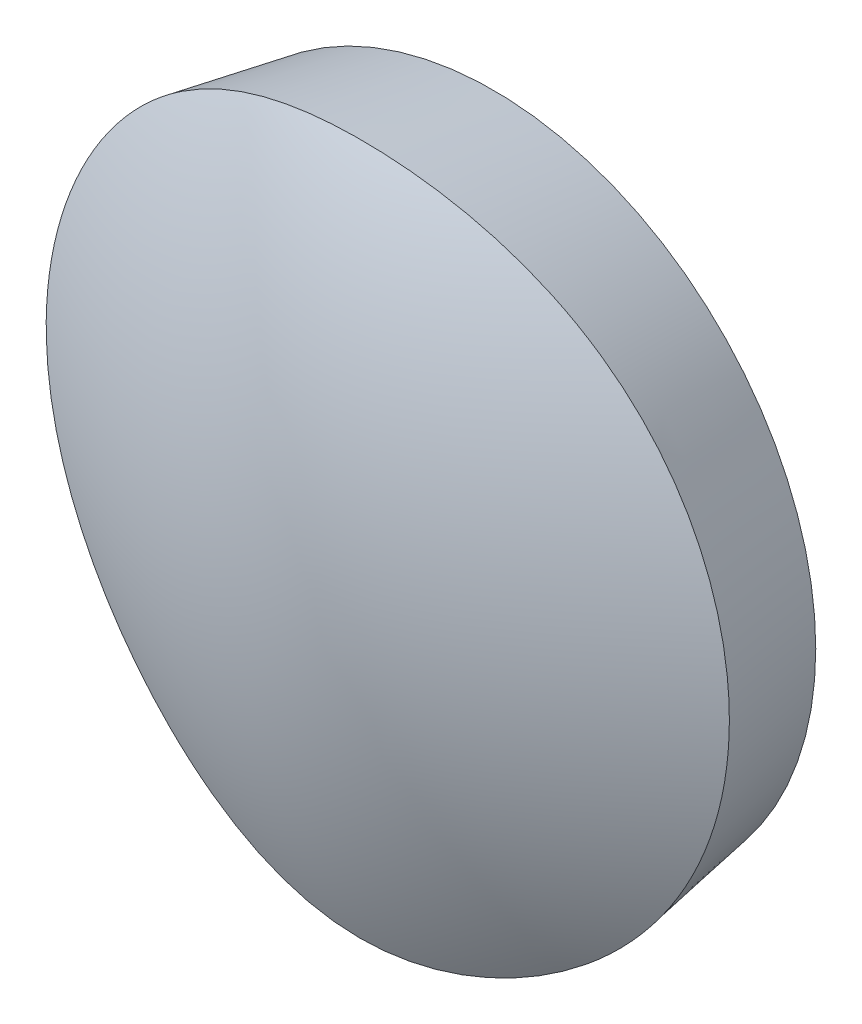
ISO-10303-21;
HEADER;
FILE_DESCRIPTION(('STEP AP214'),'2;1');
FILE_NAME('part.step','',(''),(''),'','','');
FILE_SCHEMA(('AUTOMOTIVE_DESIGN { 1 0 10303 214 1 1 1 1 }'));
ENDSEC;
DATA;
#1=APPLICATION_CONTEXT('core data for automotive mechanical design processes');
#2=APPLICATION_PROTOCOL_DEFINITION('international standard','automotive_design',2000,#1);
#3=PRODUCT_CONTEXT('',#1,'mechanical');
#4=PRODUCT('Part','Part','',(#3));
#5=PRODUCT_RELATED_PRODUCT_CATEGORY('part','',(#4));
#6=PRODUCT_DEFINITION_FORMATION('','',#4);
#7=PRODUCT_DEFINITION_CONTEXT('part definition',#1,'design');
#8=PRODUCT_DEFINITION('design','',#6,#7);
#9=PRODUCT_DEFINITION_SHAPE('','',#8);
#10=(LENGTH_UNIT() NAMED_UNIT(*) SI_UNIT(.MILLI.,.METRE.));
#11=(NAMED_UNIT(*) PLANE_ANGLE_UNIT() SI_UNIT($,.RADIAN.));
#12=(NAMED_UNIT(*) SI_UNIT($,.STERADIAN.) SOLID_ANGLE_UNIT());
#13=UNCERTAINTY_MEASURE_WITH_UNIT(LENGTH_MEASURE(1.E-05),#10,'distance_accuracy_value','');
#14=(GEOMETRIC_REPRESENTATION_CONTEXT(3) GLOBAL_UNCERTAINTY_ASSIGNED_CONTEXT((#13)) GLOBAL_UNIT_ASSIGNED_CONTEXT((#10,
#11,#12)) REPRESENTATION_CONTEXT('',''));
#15=CARTESIAN_POINT('',(0.,0.,0.));
#16=DIRECTION('',(0.,0.,1.));
#17=DIRECTION('',(1.,0.,0.));
#18=AXIS2_PLACEMENT_3D('',#15,#16,#17);
#19=CARTESIAN_POINT('',(0.,0.,0.));
#20=DIRECTION('',(0.,0.,1.));
#21=DIRECTION('',(1.,0.,0.));
#22=AXIS2_PLACEMENT_3D('',#19,#20,#21);
#23=CONICAL_SURFACE('',#22,15.,0.174532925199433);
#24=CARTESIAN_POINT('',(16.2329375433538,0.,6.99233627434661));
#25=CARTESIAN_POINT('',(16.2329350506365,-0.460523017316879,6.99233538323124));
#26=CARTESIAN_POINT('',(16.2134643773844,-0.921100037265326,6.99312577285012));
#27=CARTESIAN_POINT('',(16.1357299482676,-1.83900667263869,6.99639572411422));
#28=CARTESIAN_POINT('',(16.0774600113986,-2.2963357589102,6.99887555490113));
#29=CARTESIAN_POINT('',(15.922547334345,-3.20477158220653,7.00585027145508));
#30=CARTESIAN_POINT('',(15.8258774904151,-3.65587369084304,7.01034658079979));
#31=CARTESIAN_POINT('',(15.5949582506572,-4.54829860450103,7.02186163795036));
#32=CARTESIAN_POINT('',(15.460710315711,-4.98962178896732,7.028880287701));
#33=CARTESIAN_POINT('',(15.155803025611,-5.85916261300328,7.04607907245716));
#34=CARTESIAN_POINT('',(14.9851640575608,-6.28738743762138,7.05625743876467));
#35=CARTESIAN_POINT('',(14.6087865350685,-7.12801155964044,7.0804846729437));
#36=CARTESIAN_POINT('',(14.4030476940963,-7.54041072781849,7.09453357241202));
#37=CARTESIAN_POINT('',(13.9581305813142,-8.34644766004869,7.12717788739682));
#38=CARTESIAN_POINT('',(13.7189597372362,-8.74008956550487,7.14577229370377));
#39=CARTESIAN_POINT('',(13.2089763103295,-9.50602196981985,7.18804987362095));
#40=CARTESIAN_POINT('',(12.9381636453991,-9.87831241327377,7.21173306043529));
#41=CARTESIAN_POINT('',(12.364988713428,-10.601452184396,7.26465032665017));
#42=CARTESIAN_POINT('',(12.0624259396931,-10.9521399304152,7.29392077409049));
#43=CARTESIAN_POINT('',(11.429491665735,-11.6269226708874,7.3578173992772));
#44=CARTESIAN_POINT('',(11.099120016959,-11.9510175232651,7.39244360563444));
#45=CARTESIAN_POINT('',(10.4127610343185,-12.5705134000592,7.46649776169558));
#46=CARTESIAN_POINT('',(10.0567640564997,-12.865903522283,7.50592752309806));
#47=CARTESIAN_POINT('',(9.32165493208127,-13.4258002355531,7.58846918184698));
#48=CARTESIAN_POINT('',(8.94254249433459,-13.6903064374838,7.63158112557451));
#49=CARTESIAN_POINT('',(8.1601138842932,-14.1887692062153,7.72021873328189));
#50=CARTESIAN_POINT('',(7.75660954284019,-14.4224272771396,7.76576272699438));
#51=CARTESIAN_POINT('',(6.93110843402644,-14.8544942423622,7.85664208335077));
#52=CARTESIAN_POINT('',(6.50911152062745,-15.0529028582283,7.90197744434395));
#53=CARTESIAN_POINT('',(5.64945944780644,-15.4126348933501,7.98970063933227));
#54=CARTESIAN_POINT('',(5.21180952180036,-15.5739705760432,8.03208944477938));
#55=CARTESIAN_POINT('',(4.32352469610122,-15.8579598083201,8.11089345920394));
#56=CARTESIAN_POINT('',(3.87288979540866,-15.9806133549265,8.14730866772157));
#57=CARTESIAN_POINT('',(3.12003995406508,-16.1500777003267,8.19993879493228));
#58=CARTESIAN_POINT('',(2.8205614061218,-16.2084386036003,8.21877918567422));
#59=CARTESIAN_POINT('',(2.21844345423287,-16.3076216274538,8.25170277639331));
#60=CARTESIAN_POINT('',(1.91580416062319,-16.3484443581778,8.26578614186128));
#61=CARTESIAN_POINT('',(1.3084466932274,-16.4122226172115,8.28838686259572));
#62=CARTESIAN_POINT('',(1.00372871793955,-16.4351798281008,8.29690474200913));
#63=CARTESIAN_POINT('',(0.546091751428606,-16.4560422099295,8.30498417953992));
#64=CARTESIAN_POINT('',(0.39349545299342,-16.460734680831,8.30689455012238));
#65=CARTESIAN_POINT('',(0.0882191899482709,-16.46558366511,8.30906465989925));
#66=CARTESIAN_POINT('',(-0.0644607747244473,-16.4657401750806,8.30932439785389));
#67=CARTESIAN_POINT('',(-0.522410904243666,-16.4593993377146,8.30762251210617));
#68=CARTESIAN_POINT('',(-0.827609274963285,-16.4460924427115,8.30318011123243));
#69=CARTESIAN_POINT('',(-1.43647946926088,-16.401506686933,8.28835432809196));
#70=CARTESIAN_POINT('',(-1.74015139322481,-16.3702290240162,8.27797134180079));
#71=CARTESIAN_POINT('',(-2.4553610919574,-16.2753091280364,8.2472593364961));
#72=CARTESIAN_POINT('',(-2.86581105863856,-16.2040206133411,8.22468324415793));
#73=CARTESIAN_POINT('',(-3.67924312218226,-16.0293694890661,8.17196590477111));
#74=CARTESIAN_POINT('',(-4.08222574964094,-15.9260091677,8.14182519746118));
#75=CARTESIAN_POINT('',(-4.87875903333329,-15.6882097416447,8.07618420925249));
#76=CARTESIAN_POINT('',(-5.27230304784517,-15.5537494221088,8.04068027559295));
#77=CARTESIAN_POINT('',(-6.0475780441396,-15.2549634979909,7.96651209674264));
#78=CARTESIAN_POINT('',(-6.42930838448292,-15.0906362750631,7.92784768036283));
#79=CARTESIAN_POINT('',(-7.20269696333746,-14.7220583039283,7.84690054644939));
#80=CARTESIAN_POINT('',(-7.59345889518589,-14.5159412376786,7.80454355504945));
#81=CARTESIAN_POINT('',(-8.35719443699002,-14.072890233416,7.72065282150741));
#82=CARTESIAN_POINT('',(-8.73016755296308,-13.835955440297,7.6791191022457));
#83=CARTESIAN_POINT('',(-9.45613452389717,-13.3329152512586,7.59857531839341));
#84=CARTESIAN_POINT('',(-9.80913015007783,-13.0668124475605,7.55956503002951));
#85=CARTESIAN_POINT('',(-10.4930630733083,-12.5071462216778,7.48530376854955));
#86=CARTESIAN_POINT('',(-10.8239999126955,-12.2135822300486,7.45005287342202));
#87=CARTESIAN_POINT('',(-11.4788242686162,-11.5844330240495,7.38232390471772));
#88=CARTESIAN_POINT('',(-11.8013865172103,-11.2474397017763,7.3500952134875));
#89=CARTESIAN_POINT('',(-12.4173976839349,-10.5473586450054,7.29106735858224));
#90=CARTESIAN_POINT('',(-12.7108454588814,-10.1842698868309,7.26426840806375));
#91=CARTESIAN_POINT('',(-13.2664535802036,-9.43447486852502,7.21602994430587));
#92=CARTESIAN_POINT('',(-13.5286094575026,-9.04776524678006,7.19459119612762));
#93=CARTESIAN_POINT('',(-14.0195489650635,-8.25348627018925,7.15666644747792));
#94=CARTESIAN_POINT('',(-14.2483330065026,-7.8459171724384,7.14018038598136));
#95=CARTESIAN_POINT('',(-14.6700599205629,-7.01408544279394,7.11157256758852));
#96=CARTESIAN_POINT('',(-14.8631119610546,-6.58987862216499,7.09943740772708));
#97=CARTESIAN_POINT('',(-15.2126977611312,-5.72658760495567,7.0787384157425));
#98=CARTESIAN_POINT('',(-15.3692314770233,-5.28750339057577,7.07017458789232));
#99=CARTESIAN_POINT('',(-15.6444898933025,-4.39763118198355,7.05591179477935));
#100=CARTESIAN_POINT('',(-15.763217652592,-3.94684413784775,7.05021259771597));
#101=CARTESIAN_POINT('',(-15.9618985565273,-3.03678256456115,7.04107349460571));
#102=CARTESIAN_POINT('',(-16.0418519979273,-2.57750810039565,7.0376335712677));
#103=CARTESIAN_POINT('',(-16.1617925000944,-1.65783658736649,7.03259715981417));
#104=CARTESIAN_POINT('',(-16.2021220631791,-1.1974842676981,7.03098485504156));
#105=CARTESIAN_POINT('',(-16.2436934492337,-0.275016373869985,7.02932423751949));
#106=CARTESIAN_POINT('',(-16.2449355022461,0.187099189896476,7.0292759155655));
#107=CARTESIAN_POINT('',(-16.2083221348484,1.1097697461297,7.0307361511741));
#108=CARTESIAN_POINT('',(-16.1704672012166,1.57032475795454,7.03224468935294));
#109=CARTESIAN_POINT('',(-16.0559729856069,2.48657801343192,7.03703096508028));
#110=CARTESIAN_POINT('',(-15.9793337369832,2.9422762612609,7.04030870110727));
#111=CARTESIAN_POINT('',(-15.7883366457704,3.84350495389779,7.04902758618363));
#112=CARTESIAN_POINT('',(-15.6741521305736,4.28907224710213,7.05445881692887));
#113=CARTESIAN_POINT('',(-15.4088961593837,5.16904166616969,7.06805491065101));
#114=CARTESIAN_POINT('',(-15.257824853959,5.60344383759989,7.07621976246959));
#115=CARTESIAN_POINT('',(-14.919998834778,6.45805956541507,7.09595628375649));
#116=CARTESIAN_POINT('',(-14.7332442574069,6.87827317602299,7.10752794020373));
#117=CARTESIAN_POINT('',(-14.3255156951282,7.70161831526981,7.13477414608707));
#118=CARTESIAN_POINT('',(-14.1045415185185,8.10474974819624,7.15044871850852));
#119=CARTESIAN_POINT('',(-13.6286676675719,8.89350778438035,7.18662665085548));
#120=CARTESIAN_POINT('',(-13.3735746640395,9.27901646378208,7.20715808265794));
#121=CARTESIAN_POINT('',(-12.8324258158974,10.0273174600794,7.25343367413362));
#122=CARTESIAN_POINT('',(-12.546369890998,10.3901097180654,7.2791778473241));
#123=CARTESIAN_POINT('',(-11.9453983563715,11.090520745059,7.335999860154));
#124=CARTESIAN_POINT('',(-11.6304816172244,11.4281385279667,7.36707790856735));
#125=CARTESIAN_POINT('',(-10.9740448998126,12.0758906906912,7.43426403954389));
#126=CARTESIAN_POINT('',(-10.6325247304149,12.3860248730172,7.47037215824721));
#127=CARTESIAN_POINT('',(-9.92215435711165,12.9792397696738,7.54714415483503));
#128=CARTESIAN_POINT('',(-9.55309355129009,13.2620636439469,7.58784469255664));
#129=CARTESIAN_POINT('',(-8.79274851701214,13.7955634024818,7.6721540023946));
#130=CARTESIAN_POINT('',(-8.40146395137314,14.0462387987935,7.71576281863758));
#131=CARTESIAN_POINT('',(-7.59891280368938,14.51368935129,7.80397013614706));
#132=CARTESIAN_POINT('',(-7.18763663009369,14.7304480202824,7.8485691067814));
#133=CARTESIAN_POINT('',(-6.55799849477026,15.0286171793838,7.9143261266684));
#134=CARTESIAN_POINT('',(-6.3459908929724,15.1235149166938,7.93605562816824));
#135=CARTESIAN_POINT('',(-5.91796351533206,15.3041587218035,7.97879415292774));
#136=CARTESIAN_POINT('',(-5.70194252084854,15.3899019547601,7.9998029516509));
#137=CARTESIAN_POINT('',(-5.04859377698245,15.6329773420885,8.06118246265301));
#138=CARTESIAN_POINT('',(-4.60577810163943,15.7762510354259,8.09992802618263));
#139=CARTESIAN_POINT('',(-3.70881651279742,16.0235444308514,8.16997137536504));
#140=CARTESIAN_POINT('',(-3.25467166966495,16.1275678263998,8.20126986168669));
#141=CARTESIAN_POINT('',(-2.33893035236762,16.2948403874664,8.25328512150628));
#142=CARTESIAN_POINT('',(-1.87734492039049,16.3581451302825,8.27401631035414));
#143=CARTESIAN_POINT('',(-0.949982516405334,16.4430482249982,8.30211868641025));
#144=CARTESIAN_POINT('',(-0.484206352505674,16.4646544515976,8.30949239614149));
#145=CARTESIAN_POINT('',(0.411691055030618,16.465504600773,8.30860938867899));
#146=CARTESIAN_POINT('',(0.841813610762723,16.4478632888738,8.30150542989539));
#147=CARTESIAN_POINT('',(1.6987582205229,16.3769748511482,8.27570086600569));
#148=CARTESIAN_POINT('',(2.1255801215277,16.3237260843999,8.25699972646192));
#149=CARTESIAN_POINT('',(2.97322859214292,16.1824234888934,8.21019597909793));
#150=CARTESIAN_POINT('',(3.3940499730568,16.0943412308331,8.18208569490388));
#151=CARTESIAN_POINT('',(4.22667307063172,15.8844696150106,8.11889364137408));
#152=CARTESIAN_POINT('',(4.63847413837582,15.7626778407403,8.08381137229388));
#153=CARTESIAN_POINT('',(5.44666654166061,15.4879786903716,8.00950195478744));
#154=CARTESIAN_POINT('',(5.84316860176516,15.3353845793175,7.97031831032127));
#155=CARTESIAN_POINT('',(6.62277773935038,14.9996610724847,7.88980178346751));
#156=CARTESIAN_POINT('',(7.00588508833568,14.8165322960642,7.84846894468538));
#157=CARTESIAN_POINT('',(7.75664129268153,14.4211113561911,7.76569387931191));
#158=CARTESIAN_POINT('',(8.1242926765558,14.208823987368,7.72425167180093));
#159=CARTESIAN_POINT('',(8.84227742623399,13.7564575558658,7.64296049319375));
#160=CARTESIAN_POINT('',(9.19260992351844,13.5163771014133,7.60311160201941));
#161=CARTESIAN_POINT('',(9.90331879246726,12.9881427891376,7.52305262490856));
#162=CARTESIAN_POINT('',(10.2619759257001,12.6976313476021,7.48310515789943));
#163=CARTESIAN_POINT('',(10.954242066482,12.0875856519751,7.4078567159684));
#164=CARTESIAN_POINT('',(11.2878497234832,11.7680498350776,7.37255599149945));
#165=CARTESIAN_POINT('',(11.9277914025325,11.1020305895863,7.3072297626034));
#166=CARTESIAN_POINT('',(12.2341162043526,10.755538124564,7.2772060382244));
#167=CARTESIAN_POINT('',(12.8171333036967,10.0380692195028,7.22260316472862));
#168=CARTESIAN_POINT('',(13.0938261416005,9.66709322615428,7.19802391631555));
#169=CARTESIAN_POINT('',(13.6179834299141,8.89956425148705,7.15386001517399));
#170=CARTESIAN_POINT('',(13.8651459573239,8.50280215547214,7.13432491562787));
#171=CARTESIAN_POINT('',(14.3252311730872,7.6896705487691,7.100019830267));
#172=CARTESIAN_POINT('',(14.5381520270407,7.27329998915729,7.08525009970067));
#173=CARTESIAN_POINT('',(14.927882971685,6.42424281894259,7.0597873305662));
#174=CARTESIAN_POINT('',(15.1047192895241,5.99156833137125,7.04909132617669));
#175=CARTESIAN_POINT('',(15.4210106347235,5.11274866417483,7.03102135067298));
#176=CARTESIAN_POINT('',(15.5604722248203,4.66660586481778,7.02364679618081));
#177=CARTESIAN_POINT('',(15.7721180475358,3.87208890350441,7.01299025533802));
#178=CARTESIAN_POINT('',(15.8524155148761,3.52585827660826,7.00915125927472));
#179=CARTESIAN_POINT('',(15.9903698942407,2.8288184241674,7.00275724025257));
#180=CARTESIAN_POINT('',(16.0480225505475,2.47800835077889,7.00020245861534));
#181=CARTESIAN_POINT('',(16.1403746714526,1.77338415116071,6.99619180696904));
#182=CARTESIAN_POINT('',(16.1750748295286,1.41957011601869,6.99473590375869));
#183=CARTESIAN_POINT('',(16.221355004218,0.710514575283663,6.99280857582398));
#184=CARTESIAN_POINT('',(16.2329394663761,0.355273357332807,6.99233696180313));
#185=CARTESIAN_POINT('',(16.2329375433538,0.,6.99233627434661));
#186=B_SPLINE_CURVE_WITH_KNOTS('',3,(#24,#25,#26,#27,#28,#29,#30,#31,#32,#33,#34,#35,#36,#37,
#38,#39,#40,#41,#42,#43,#44,#45,#46,#47,#48,#49,#50,#51,#52,#53,#54,#55,#56,#57,#58,#59,#60,#61,
#62,#63,#64,#65,#66,#67,#68,#69,#70,#71,#72,#73,#74,#75,#76,#77,#78,#79,#80,#81,#82,#83,#84,#85,
#86,#87,#88,#89,#90,#91,#92,#93,#94,#95,#96,#97,#98,#99,#100,#101,#102,#103,#104,#105,#106,#107,
#108,#109,#110,#111,#112,#113,#114,#115,#116,#117,#118,#119,#120,#121,#122,#123,#124,#125,#126,
#127,#128,#129,#130,#131,#132,#133,#134,#135,#136,#137,#138,#139,#140,#141,#142,#143,#144,#145,
#146,#147,#148,#149,#150,#151,#152,#153,#154,#155,#156,#157,#158,#159,#160,#161,#162,#163,#164,
#165,#166,#167,#168,#169,#170,#171,#172,#173,#174,#175,#176,#177,#178,#179,#180,#181,#182,#183,
#184,#185),.UNSPECIFIED.,.T.,.F.,(4,2,2,2,2,2,2,2,2,2,2,2,2,2,2,2,2,2,2,2,2,2,2,2,2,2,2,2,2,2,2,
2,2,2,2,2,2,2,2,2,2,2,2,2,2,2,2,2,2,2,2,2,2,2,2,2,2,2,2,2,2,2,2,2,2,2,2,2,2,2,2,2,2,2,2,2,2,2,2,
2,4),(0.,1.38125141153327,2.76272291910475,4.14517124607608,5.52756583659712,6.9091880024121,
8.29082144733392,9.67214841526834,11.0534789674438,12.4441278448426,13.8347841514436,
15.225966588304,16.6171665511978,18.0209709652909,19.4247864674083,20.8281369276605,
22.231487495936,23.1480666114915,24.0646138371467,24.9810747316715,25.439049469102,
25.8970245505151,26.8129208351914,27.7287560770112,28.9788884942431,30.2289317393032,
31.4798302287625,32.7307965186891,34.0607921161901,35.3908246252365,36.7207390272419,
38.0506810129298,39.451803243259,40.852980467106,42.2543575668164,43.6557173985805,
45.0527224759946,46.4497292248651,47.846622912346,49.2435059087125,50.6282053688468,
52.0128966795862,53.3975707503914,54.7822436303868,56.1606118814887,57.5389745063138,
58.9173318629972,60.2956969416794,61.6822322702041,63.0687711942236,64.455364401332,
65.8419675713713,67.2405487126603,68.639151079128,70.0384312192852,70.7381198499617,
71.4380245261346,72.8371617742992,74.2361673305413,75.6332592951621,77.0300873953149,
78.320040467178,79.610052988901,80.9011205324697,82.1922806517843,83.4709171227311,
84.7495276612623,86.0279282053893,87.30639279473,88.6946002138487,90.0828824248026,
91.4716320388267,92.8603563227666,94.2622445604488,95.6642078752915,97.065148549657,
98.4658430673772,99.5314551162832,100.597267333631,101.663047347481,102.728622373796),.UNSPECIFIED.);
#187=CARTESIAN_POINT('',(16.2329375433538,0.,6.99233627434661));
#188=VERTEX_POINT('',#187);
#189=EDGE_CURVE('E10',#188,#188,#186,.T.);
#190=ORIENTED_EDGE('',*,*,#189,.T.);
#191=EDGE_LOOP('',(#190));
#192=FACE_BOUND('',#191,.T.);
#193=CARTESIAN_POINT('',(0.,0.,2.));
#194=DIRECTION('',(0.,0.,-1.));
#195=DIRECTION('',(-1.,0.,0.));
#196=AXIS2_PLACEMENT_3D('',#193,#194,#195);
#197=CIRCLE('',#196,15.3526539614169);
#198=CARTESIAN_POINT('',(-15.3526539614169,0.,2.));
#199=VERTEX_POINT('',#198);
#200=EDGE_CURVE('E41',#199,#199,#197,.T.);
#201=ORIENTED_EDGE('',*,*,#200,.F.);
#202=EDGE_LOOP('',(#201));
#203=FACE_BOUND('',#202,.T.);
#204=ADVANCED_FACE('F34',(#192,#203),#23,.T.);
#205=CARTESIAN_POINT('',(-24.0021039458,11.75,0.00989828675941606));
#206=CARTESIAN_POINT('',(-16.000751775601,15.3806080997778,3.50600378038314));
#207=CARTESIAN_POINT('',(-0.0350116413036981,22.625051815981,10.4820636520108));
#208=CARTESIAN_POINT('',(15.9229542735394,15.3694178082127,3.51205281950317));
#209=CARTESIAN_POINT('',(23.8834641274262,11.75,0.035115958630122));
#210=CARTESIAN_POINT('',(-24.5950206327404,4.0878307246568,2.79935198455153));
#211=CARTESIAN_POINT('',(-17.1613070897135,5.446271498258,8.06184416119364));
#212=CARTESIAN_POINT('',(-0.0407960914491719,8.57488280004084,20.1818370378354));
#213=CARTESIAN_POINT('',(17.076761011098,5.44208450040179,8.0632306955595));
#214=CARTESIAN_POINT('',(24.4763808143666,4.08783072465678,2.82456965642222));
#215=CARTESIAN_POINT('',(-24.5950206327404,-4.08783072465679,2.79935198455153));
#216=CARTESIAN_POINT('',(-17.1613070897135,-5.446271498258,8.06184416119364));
#217=CARTESIAN_POINT('',(-0.0407960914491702,-8.57488280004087,20.1818370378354));
#218=CARTESIAN_POINT('',(17.076761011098,-5.44208450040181,8.06323069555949));
#219=CARTESIAN_POINT('',(24.4763808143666,-4.0878307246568,2.82456965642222));
#220=CARTESIAN_POINT('',(-24.0021039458,-11.75,0.00989828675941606));
#221=CARTESIAN_POINT('',(-16.000751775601,-15.3806080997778,3.50600378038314));
#222=CARTESIAN_POINT('',(-0.0350116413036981,-22.625051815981,10.4820636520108));
#223=CARTESIAN_POINT('',(15.9229542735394,-15.3694178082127,3.51205281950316));
#224=CARTESIAN_POINT('',(23.8834641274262,-11.75,0.035115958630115));
#225=(BOUNDED_SURFACE() B_SPLINE_SURFACE(3,3,((#205,#206,#207,#208,#209),(#210,#211,#212,#213,
#214),(#215,#216,#217,#218,#219),(#220,#221,#222,#223,#224)),.UNSPECIFIED.,.F.,.F.,
.F.) B_SPLINE_SURFACE_WITH_KNOTS((4,4),(4,1,4),(0.,1.),(0.,0.501157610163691,1.),
.UNSPECIFIED.) GEOMETRIC_REPRESENTATION_ITEM() RATIONAL_B_SPLINE_SURFACE(((1.,1.,1.,1.,1.),
(0.958128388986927,0.958128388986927,0.868870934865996,0.958128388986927,0.958128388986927),
(0.958128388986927,0.958128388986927,0.868870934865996,0.958128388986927,0.958128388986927),(1.,
1.,1.,1.,1.))) REPRESENTATION_ITEM('') SURFACE());
#226=ORIENTED_EDGE('',*,*,#189,.F.);
#227=EDGE_LOOP('',(#226));
#228=FACE_BOUND('',#227,.T.);
#229=ADVANCED_FACE('F36',(#228),#225,.T.);
#230=CARTESIAN_POINT('',(0.,0.,2.));
#231=DIRECTION('',(0.,0.,-1.));
#232=DIRECTION('',(-1.,0.,0.));
#233=AXIS2_PLACEMENT_3D('',#230,#231,#232);
#234=PLANE('',#233);
#235=CARTESIAN_POINT('',(0.,0.,2.));
#236=DIRECTION('',(0.,0.,-1.));
#237=DIRECTION('',(-1.,0.,0.));
#238=AXIS2_PLACEMENT_3D('',#235,#236,#237);
#239=CIRCLE('',#238,15.2526539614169);
#240=CARTESIAN_POINT('',(-15.2526539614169,0.,2.));
#241=VERTEX_POINT('',#240);
#242=EDGE_CURVE('E72',#241,#241,#239,.T.);
#243=ORIENTED_EDGE('',*,*,#242,.F.);
#244=EDGE_LOOP('',(#243));
#245=FACE_BOUND('',#244,.T.);
#246=ORIENTED_EDGE('',*,*,#200,.T.);
#247=EDGE_LOOP('',(#246));
#248=FACE_BOUND('',#247,.T.);
#249=ADVANCED_FACE('F57',(#245,#248),#234,.T.);
#250=CARTESIAN_POINT('',(0.,0.,2.));
#251=DIRECTION('',(0.,0.,1.));
#252=DIRECTION('',(-1.,0.,0.));
#253=AXIS2_PLACEMENT_3D('',#250,#251,#252);
#254=CONICAL_SURFACE('',#253,15.2526539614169,0.174532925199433);
#255=CARTESIAN_POINT('',(0.,0.,7.));
#256=DIRECTION('',(0.,0.,-1.));
#257=DIRECTION('',(-1.,0.,0.));
#258=AXIS2_PLACEMENT_3D('',#255,#256,#257);
#259=CIRCLE('',#258,16.1342888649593);
#260=CARTESIAN_POINT('',(-16.1342888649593,0.,7.));
#261=VERTEX_POINT('',#260);
#262=EDGE_CURVE('E48',#261,#261,#259,.T.);
#263=ORIENTED_EDGE('',*,*,#262,.F.);
#264=EDGE_LOOP('',(#263));
#265=FACE_BOUND('',#264,.T.);
#266=ORIENTED_EDGE('',*,*,#242,.T.);
#267=EDGE_LOOP('',(#266));
#268=FACE_BOUND('',#267,.T.);
#269=ADVANCED_FACE('F60',(#265,#268),#254,.F.);
#270=CARTESIAN_POINT('',(0.,0.,7.));
#271=DIRECTION('',(0.,0.,-1.));
#272=DIRECTION('',(-1.,0.,0.));
#273=AXIS2_PLACEMENT_3D('',#270,#271,#272);
#274=PLANE('',#273);
#275=ORIENTED_EDGE('',*,*,#262,.T.);
#276=EDGE_LOOP('',(#275));
#277=FACE_BOUND('',#276,.T.);
#278=ADVANCED_FACE('F64',(#277),#274,.T.);
#279=CLOSED_SHELL('',(#204,#229,#249,#269,#278));
#280=MANIFOLD_SOLID_BREP('B2',#279);
#281=ADVANCED_BREP_SHAPE_REPRESENTATION('',(#18,#280),#14);
#282=SHAPE_DEFINITION_REPRESENTATION(#9,#281);
ENDSEC;
END-ISO-10303-21;
